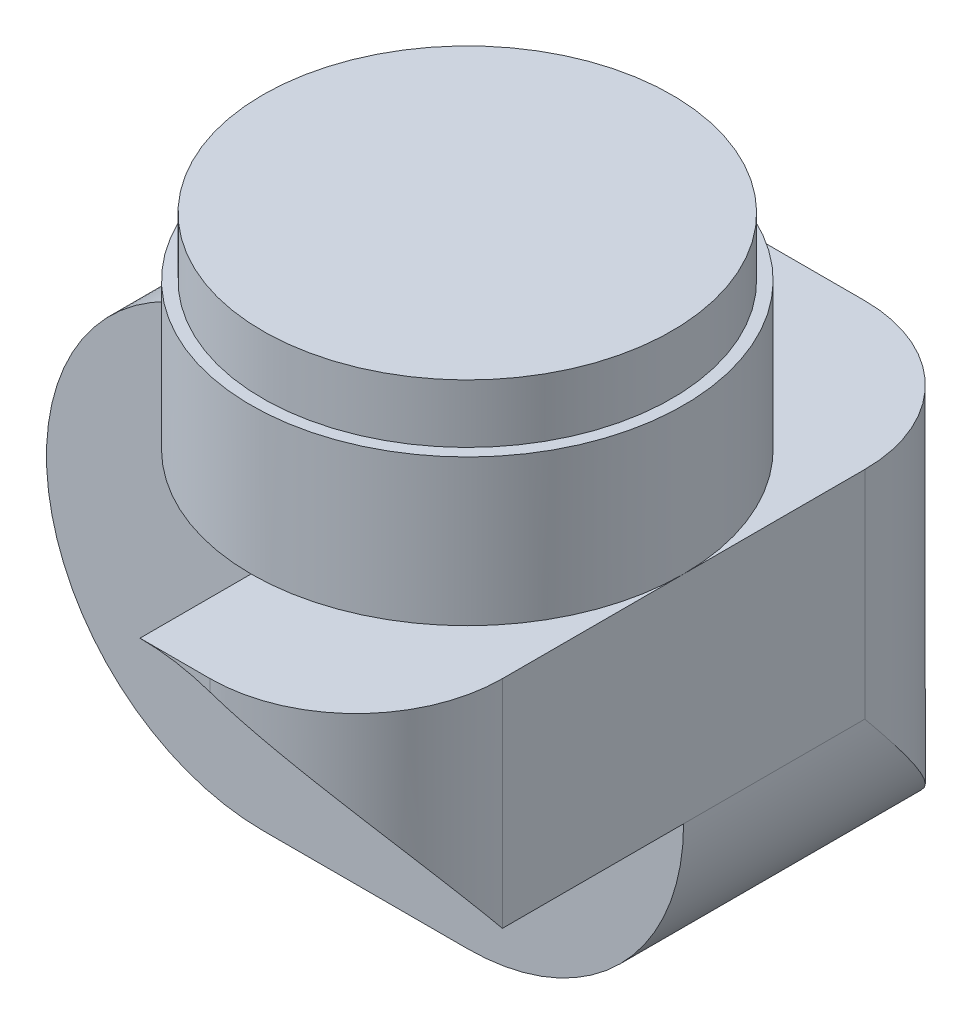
ISO-10303-21;
HEADER;
FILE_DESCRIPTION(('STEP AP214'),'2;1');
FILE_NAME('part.step','',(''),(''),'','','');
FILE_SCHEMA(('AUTOMOTIVE_DESIGN { 1 0 10303 214 1 1 1 1 }'));
ENDSEC;
DATA;
#1=APPLICATION_CONTEXT('core data for automotive mechanical design processes');
#2=APPLICATION_PROTOCOL_DEFINITION('international standard','automotive_design',2000,#1);
#3=PRODUCT_CONTEXT('',#1,'mechanical');
#4=PRODUCT('Part','Part','',(#3));
#5=PRODUCT_RELATED_PRODUCT_CATEGORY('part','',(#4));
#6=PRODUCT_DEFINITION_FORMATION('','',#4);
#7=PRODUCT_DEFINITION_CONTEXT('part definition',#1,'design');
#8=PRODUCT_DEFINITION('design','',#6,#7);
#9=PRODUCT_DEFINITION_SHAPE('','',#8);
#10=(LENGTH_UNIT() NAMED_UNIT(*) SI_UNIT(.MILLI.,.METRE.));
#11=(NAMED_UNIT(*) PLANE_ANGLE_UNIT() SI_UNIT($,.RADIAN.));
#12=(NAMED_UNIT(*) SI_UNIT($,.STERADIAN.) SOLID_ANGLE_UNIT());
#13=UNCERTAINTY_MEASURE_WITH_UNIT(LENGTH_MEASURE(1.E-05),#10,'distance_accuracy_value','');
#14=(GEOMETRIC_REPRESENTATION_CONTEXT(3) GLOBAL_UNCERTAINTY_ASSIGNED_CONTEXT((#13)) GLOBAL_UNIT_ASSIGNED_CONTEXT((#10,
#11,#12)) REPRESENTATION_CONTEXT('',''));
#15=CARTESIAN_POINT('',(0.,0.,0.));
#16=DIRECTION('',(0.,0.,1.));
#17=DIRECTION('',(1.,0.,0.));
#18=AXIS2_PLACEMENT_3D('',#15,#16,#17);
#19=CARTESIAN_POINT('',(-35.,-590.,-56.));
#20=DIRECTION('',(0.,0.,1.));
#21=DIRECTION('',(1.,0.,0.));
#22=AXIS2_PLACEMENT_3D('',#19,#20,#21);
#23=PLANE('',#22);
#24=DIRECTION('',(-1.,0.,0.));
#25=VECTOR('',#24,1.);
#26=CARTESIAN_POINT('',(37.0000000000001,-553.,-56.));
#27=LINE('',#26,#25);
#28=CARTESIAN_POINT('',(12.0000000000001,-553.,-56.));
#29=VERTEX_POINT('',#28);
#30=CARTESIAN_POINT('',(-35.,-553.,-56.));
#31=VERTEX_POINT('',#30);
#32=EDGE_CURVE('E253',#29,#31,#27,.T.);
#33=ORIENTED_EDGE('',*,*,#32,.F.);
#34=DIRECTION('',(0.,1.,0.));
#35=VECTOR('',#34,1.);
#36=CARTESIAN_POINT('',(12.0000000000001,-590.,-56.));
#37=LINE('',#36,#35);
#38=CARTESIAN_POINT('',(12.0000000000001,-625.,-56.));
#39=VERTEX_POINT('',#38);
#40=EDGE_CURVE('E55',#29,#39,#37,.F.);
#41=ORIENTED_EDGE('',*,*,#40,.T.);
#42=CARTESIAN_POINT('',(0.,-590.,-56.));
#43=DIRECTION('',(0.,0.,1.));
#44=DIRECTION('',(1.,0.,0.));
#45=AXIS2_PLACEMENT_3D('',#42,#43,#44);
#46=CIRCLE('',#45,37.);
#47=CARTESIAN_POINT('',(0.,-627.,-56.));
#48=VERTEX_POINT('',#47);
#49=EDGE_CURVE('E264',#48,#39,#46,.T.);
#50=ORIENTED_EDGE('',*,*,#49,.F.);
#51=DIRECTION('',(1.,0.,0.));
#52=VECTOR('',#51,1.);
#53=CARTESIAN_POINT('',(-35.,-627.,-56.));
#54=LINE('',#53,#52);
#55=CARTESIAN_POINT('',(-35.,-627.,-56.));
#56=VERTEX_POINT('',#55);
#57=EDGE_CURVE('E418',#56,#48,#54,.T.);
#58=ORIENTED_EDGE('',*,*,#57,.F.);
#59=CARTESIAN_POINT('',(-35.,-590.,-56.));
#60=DIRECTION('',(0.,0.,1.));
#61=DIRECTION('',(1.,0.,0.));
#62=AXIS2_PLACEMENT_3D('',#59,#60,#61);
#63=CIRCLE('',#62,37.);
#64=EDGE_CURVE('E137',#31,#56,#63,.T.);
#65=ORIENTED_EDGE('',*,*,#64,.F.);
#66=EDGE_LOOP('',(#33,#41,#50,#58,#65));
#67=FACE_BOUND('',#66,.T.);
#68=CARTESIAN_POINT('',(-35.,-590.,-56.));
#69=DIRECTION('',(0.,0.,1.));
#70=DIRECTION('',(1.,0.,0.));
#71=AXIS2_PLACEMENT_3D('',#68,#69,#70);
#72=CIRCLE('',#71,35.);
#73=CARTESIAN_POINT('',(0.,-590.,-56.));
#74=VERTEX_POINT('',#73);
#75=EDGE_CURVE('E11',#74,#74,#72,.F.);
#76=ORIENTED_EDGE('',*,*,#75,.F.);
#77=EDGE_LOOP('',(#76));
#78=FACE_BOUND('',#77,.T.);
#79=ADVANCED_FACE('F32',(#67,#78),#23,.F.);
#80=CARTESIAN_POINT('',(-35.,-590.,56.));
#81=DIRECTION('',(0.,0.,-1.));
#82=DIRECTION('',(-1.,0.,0.));
#83=AXIS2_PLACEMENT_3D('',#80,#81,#82);
#84=CYLINDRICAL_SURFACE('',#83,37.);
#85=CARTESIAN_POINT('',(-35.,-590.,0.));
#86=DIRECTION('',(0.,0.,1.));
#87=DIRECTION('',(1.,0.,0.));
#88=AXIS2_PLACEMENT_3D('',#85,#86,#87);
#89=CIRCLE('',#88,37.);
#90=CARTESIAN_POINT('',(-35.,-553.,0.));
#91=VERTEX_POINT('',#90);
#92=CARTESIAN_POINT('',(-35.,-627.,0.));
#93=VERTEX_POINT('',#92);
#94=EDGE_CURVE('E110',#91,#93,#89,.T.);
#95=ORIENTED_EDGE('',*,*,#94,.F.);
#96=DIRECTION('',(0.,0.,-1.));
#97=VECTOR('',#96,1.);
#98=CARTESIAN_POINT('',(-35.,-553.,56.));
#99=LINE('',#98,#97);
#100=CARTESIAN_POINT('',(-35.,-553.,-11.9999999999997));
#101=VERTEX_POINT('',#100);
#102=EDGE_CURVE('E246',#91,#101,#99,.T.);
#103=ORIENTED_EDGE('',*,*,#102,.T.);
#104=EDGE_CURVE('E249',#101,#31,#99,.T.);
#105=ORIENTED_EDGE('',*,*,#104,.T.);
#106=ORIENTED_EDGE('',*,*,#64,.T.);
#107=DIRECTION('',(0.,0.,-1.));
#108=VECTOR('',#107,1.);
#109=CARTESIAN_POINT('',(-35.,-627.,56.));
#110=LINE('',#109,#108);
#111=EDGE_CURVE('E128',#93,#56,#110,.T.);
#112=ORIENTED_EDGE('',*,*,#111,.F.);
#113=EDGE_LOOP('',(#95,#103,#105,#106,#112));
#114=FACE_BOUND('',#113,.T.);
#115=ADVANCED_FACE('F134',(#114),#84,.T.);
#116=CARTESIAN_POINT('',(-35.,-627.,56.));
#117=DIRECTION('',(0.,1.,0.));
#118=DIRECTION('',(0.,0.,1.));
#119=AXIS2_PLACEMENT_3D('',#116,#117,#118);
#120=PLANE('',#119);
#121=DIRECTION('',(1.,0.,0.));
#122=VECTOR('',#121,1.);
#123=CARTESIAN_POINT('',(-35.,-627.,0.));
#124=LINE('',#123,#122);
#125=CARTESIAN_POINT('',(0.,-627.,0.));
#126=VERTEX_POINT('',#125);
#127=EDGE_CURVE('E114',#93,#126,#124,.T.);
#128=ORIENTED_EDGE('',*,*,#127,.F.);
#129=ORIENTED_EDGE('',*,*,#111,.T.);
#130=ORIENTED_EDGE('',*,*,#57,.T.);
#131=DIRECTION('',(0.,0.,-1.));
#132=VECTOR('',#131,1.);
#133=CARTESIAN_POINT('',(0.,-627.,56.));
#134=LINE('',#133,#132);
#135=EDGE_CURVE('E130',#126,#48,#134,.T.);
#136=ORIENTED_EDGE('',*,*,#135,.F.);
#137=EDGE_LOOP('',(#128,#129,#130,#136));
#138=FACE_BOUND('',#137,.T.);
#139=ADVANCED_FACE('F126',(#138),#120,.F.);
#140=CARTESIAN_POINT('',(0.,-590.,56.));
#141=DIRECTION('',(0.,0.,-1.));
#142=DIRECTION('',(-1.,0.,0.));
#143=AXIS2_PLACEMENT_3D('',#140,#141,#142);
#144=CYLINDRICAL_SURFACE('',#143,37.);
#145=CARTESIAN_POINT('',(0.,-590.,0.));
#146=DIRECTION('',(0.,0.,1.));
#147=DIRECTION('',(-1.,0.,0.));
#148=AXIS2_PLACEMENT_3D('',#145,#146,#147);
#149=CIRCLE('',#148,36.9999999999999);
#150=CARTESIAN_POINT('',(37.0000000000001,-590.,0.));
#151=VERTEX_POINT('',#150);
#152=EDGE_CURVE('E413',#126,#151,#149,.T.);
#153=ORIENTED_EDGE('',*,*,#152,.F.);
#154=ORIENTED_EDGE('',*,*,#135,.T.);
#155=ORIENTED_EDGE('',*,*,#49,.T.);
#156=CARTESIAN_POINT('',(12.0000000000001,-625.,-56.));
#157=CARTESIAN_POINT('',(12.350024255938,-624.880004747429,-56.0000087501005));
#158=CARTESIAN_POINT('',(12.6982160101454,-624.754744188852,-55.9926493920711));
#159=CARTESIAN_POINT('',(13.3901199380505,-624.494073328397,-55.9637201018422));
#160=CARTESIAN_POINT('',(13.7338328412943,-624.358664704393,-55.9421525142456));
#161=CARTESIAN_POINT('',(14.4155751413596,-624.078246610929,-55.8853741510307));
#162=CARTESIAN_POINT('',(14.7536122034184,-623.933251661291,-55.8501836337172));
#163=CARTESIAN_POINT('',(15.4238605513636,-623.633901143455,-55.766737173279));
#164=CARTESIAN_POINT('',(15.7560716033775,-623.479545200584,-55.7184807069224));
#165=CARTESIAN_POINT('',(16.7364305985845,-623.006279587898,-55.5560956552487));
#166=CARTESIAN_POINT('',(17.3753705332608,-622.674256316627,-55.4237382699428));
#167=CARTESIAN_POINT('',(18.6248083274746,-621.978563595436,-55.1148619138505));
#168=CARTESIAN_POINT('',(19.235292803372,-621.614879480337,-54.938322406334));
#169=CARTESIAN_POINT('',(20.5584104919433,-620.77491028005,-54.5019399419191));
#170=CARTESIAN_POINT('',(21.2633816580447,-620.29162490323,-54.232297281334));
#171=CARTESIAN_POINT('',(22.6245312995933,-619.289001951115,-53.6422154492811));
#172=CARTESIAN_POINT('',(23.2807035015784,-618.76965975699,-53.3217697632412));
#173=CARTESIAN_POINT('',(24.545932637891,-617.698144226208,-52.6360670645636));
#174=CARTESIAN_POINT('',(25.1547874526,-617.145846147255,-52.2706333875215));
#175=CARTESIAN_POINT('',(26.3225144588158,-616.015111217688,-51.5025383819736));
#176=CARTESIAN_POINT('',(26.8813826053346,-615.43667225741,-51.0998740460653));
#177=CARTESIAN_POINT('',(28.155765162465,-614.03055189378,-50.1017060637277));
#178=CARTESIAN_POINT('',(28.8487096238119,-613.192680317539,-49.4916615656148));
#179=CARTESIAN_POINT('',(30.1431940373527,-611.483435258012,-48.2234147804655));
#180=CARTESIAN_POINT('',(30.7447005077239,-610.612049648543,-47.5651949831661));
#181=CARTESIAN_POINT('',(31.8601695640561,-608.842104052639,-46.2100155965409));
#182=CARTESIAN_POINT('',(32.3740369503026,-607.943515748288,-45.5130149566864));
#183=CARTESIAN_POINT('',(33.3166904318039,-606.125947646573,-44.0892177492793));
#184=CARTESIAN_POINT('',(33.7454811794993,-605.20696896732,-43.3624228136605));
#185=CARTESIAN_POINT('',(34.6177030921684,-603.122129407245,-41.701643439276));
#186=CARTESIAN_POINT('',(35.0381591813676,-601.951809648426,-40.761158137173));
#187=CARTESIAN_POINT('',(35.755830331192,-599.59374787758,-38.8548160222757));
#188=CARTESIAN_POINT('',(36.0529989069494,-598.405999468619,-37.8889497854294));
#189=CARTESIAN_POINT('',(36.5267596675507,-596.022397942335,-35.9435081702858));
#190=CARTESIAN_POINT('',(36.7036136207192,-594.826568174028,-34.9639673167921));
#191=CARTESIAN_POINT('',(36.9397072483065,-592.430241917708,-32.9976343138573));
#192=CARTESIAN_POINT('',(36.9990244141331,-591.229749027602,-32.0108473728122));
#193=CARTESIAN_POINT('',(36.999996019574,-590.019812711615,-31.0162859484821));
#194=CARTESIAN_POINT('',(36.9999999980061,-590.009906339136,-31.0081429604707));
#195=CARTESIAN_POINT('',(37.0000000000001,-590.,-31.));
#196=B_SPLINE_CURVE_WITH_KNOTS('',3,(#156,#157,#158,#159,#160,#161,#162,#163,#164,#165,#166,
#167,#168,#169,#170,#171,#172,#173,#174,#175,#176,#177,#178,#179,#180,#181,#182,#183,#184,#185,
#186,#187,#188,#189,#190,#191,#192,#193,#194,#195),.UNSPECIFIED.,.F.,.F.,(4,2,2,2,2,2,2,2,2,2,2,
2,2,2,2,2,2,2,2,4),(0.,1.10990953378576,2.21963595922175,3.3277184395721,4.43584530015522,
6.62917781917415,8.82353174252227,11.5082879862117,14.1933887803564,16.8893918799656,
19.5856129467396,23.3202782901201,27.0563078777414,30.7963703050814,34.5362281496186,
39.2079700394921,43.8814717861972,48.5447726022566,53.2049979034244,53.2434686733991),.UNSPECIFIED.);
#197=CARTESIAN_POINT('',(37.0000000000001,-590.,-31.));
#198=VERTEX_POINT('',#197);
#199=EDGE_CURVE('E167',#39,#198,#196,.T.);
#200=ORIENTED_EDGE('',*,*,#199,.T.);
#201=DIRECTION('',(0.,0.,-1.));
#202=VECTOR('',#201,1.);
#203=CARTESIAN_POINT('',(37.0000000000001,-590.,56.));
#204=LINE('',#203,#202);
#205=EDGE_CURVE('E258',#151,#198,#204,.T.);
#206=ORIENTED_EDGE('',*,*,#205,.F.);
#207=EDGE_LOOP('',(#153,#154,#155,#200,#206));
#208=FACE_BOUND('',#207,.T.);
#209=ADVANCED_FACE('F180',(#208),#144,.T.);
#210=CARTESIAN_POINT('',(-35.,-590.,56.));
#211=DIRECTION('',(0.,0.,1.));
#212=DIRECTION('',(1.,0.,0.));
#213=AXIS2_PLACEMENT_3D('',#210,#211,#212);
#214=PLANE('',#213);
#215=DIRECTION('',(-1.,0.,0.));
#216=VECTOR('',#215,1.);
#217=CARTESIAN_POINT('',(37.0000000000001,-553.,56.));
#218=LINE('',#217,#216);
#219=CARTESIAN_POINT('',(12.0000000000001,-553.,56.));
#220=VERTEX_POINT('',#219);
#221=CARTESIAN_POINT('',(0.,-553.,56.));
#222=VERTEX_POINT('',#221);
#223=EDGE_CURVE('E254',#220,#222,#218,.T.);
#224=ORIENTED_EDGE('',*,*,#223,.T.);
#225=CARTESIAN_POINT('',(0.,-590.,56.));
#226=DIRECTION('',(0.,0.,1.));
#227=DIRECTION('',(1.,0.,0.));
#228=AXIS2_PLACEMENT_3D('',#225,#226,#227);
#229=CIRCLE('',#228,37.);
#230=CARTESIAN_POINT('',(12.0000000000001,-555.,56.));
#231=VERTEX_POINT('',#230);
#232=EDGE_CURVE('E410',#231,#222,#229,.T.);
#233=ORIENTED_EDGE('',*,*,#232,.F.);
#234=DIRECTION('',(0.,1.,0.));
#235=VECTOR('',#234,1.);
#236=CARTESIAN_POINT('',(12.0000000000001,-553.,56.));
#237=LINE('',#236,#235);
#238=EDGE_CURVE('E157',#231,#220,#237,.T.);
#239=ORIENTED_EDGE('',*,*,#238,.T.);
#240=EDGE_LOOP('',(#224,#233,#239));
#241=FACE_BOUND('',#240,.T.);
#242=ADVANCED_FACE('F185',(#241),#214,.T.);
#243=CARTESIAN_POINT('',(12.0000000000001,-590.,31.));
#244=DIRECTION('',(0.,-1.,0.));
#245=DIRECTION('',(0.,0.,-1.));
#246=AXIS2_PLACEMENT_3D('',#243,#244,#245);
#247=CYLINDRICAL_SURFACE('',#246,25.);
#248=ORIENTED_EDGE('',*,*,#238,.F.);
#249=CARTESIAN_POINT('',(12.0000000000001,-555.,56.));
#250=CARTESIAN_POINT('',(12.3500242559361,-555.11999525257,56.0000087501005));
#251=CARTESIAN_POINT('',(12.6982160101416,-555.245255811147,55.9926493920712));
#252=CARTESIAN_POINT('',(13.3901199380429,-555.5059266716,55.9637201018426));
#253=CARTESIAN_POINT('',(13.7338328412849,-555.641335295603,55.9421525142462));
#254=CARTESIAN_POINT('',(14.4155751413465,-555.921753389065,55.885374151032));
#255=CARTESIAN_POINT('',(14.7536122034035,-556.066748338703,55.8501836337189));
#256=CARTESIAN_POINT('',(15.4238605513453,-556.366098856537,55.7667371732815));
#257=CARTESIAN_POINT('',(15.7560716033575,-556.520454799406,55.7184807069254));
#258=CARTESIAN_POINT('',(16.7364305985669,-556.993720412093,55.5560956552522));
#259=CARTESIAN_POINT('',(17.375370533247,-557.325743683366,55.4237382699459));
#260=CARTESIAN_POINT('',(18.6248083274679,-558.02143640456,55.1148619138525));
#261=CARTESIAN_POINT('',(19.2352928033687,-558.385120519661,54.9383224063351));
#262=CARTESIAN_POINT('',(20.5584104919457,-559.225089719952,54.5019399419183));
#263=CARTESIAN_POINT('',(21.2633816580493,-559.708375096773,54.2322972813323));
#264=CARTESIAN_POINT('',(22.6245312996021,-560.710998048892,53.642215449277));
#265=CARTESIAN_POINT('',(23.2807035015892,-561.230340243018,53.3217697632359));
#266=CARTESIAN_POINT('',(24.5459326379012,-562.301855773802,52.6360670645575));
#267=CARTESIAN_POINT('',(25.1547874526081,-562.854153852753,52.2706333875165));
#268=CARTESIAN_POINT('',(26.3225144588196,-563.984888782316,51.5025383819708));
#269=CARTESIAN_POINT('',(26.8813826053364,-564.563327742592,51.0998740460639));
#270=CARTESIAN_POINT('',(28.1557651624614,-565.969448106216,50.1017060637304));
#271=CARTESIAN_POINT('',(28.8487096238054,-566.807319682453,49.4916615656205));
#272=CARTESIAN_POINT('',(30.1431940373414,-568.516564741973,48.2234147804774));
#273=CARTESIAN_POINT('',(30.7447005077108,-569.387950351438,47.5651949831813));
#274=CARTESIAN_POINT('',(31.8601695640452,-571.157895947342,46.2100155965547));
#275=CARTESIAN_POINT('',(32.3740369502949,-572.056484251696,45.5130149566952));
#276=CARTESIAN_POINT('',(33.3166904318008,-573.874052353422,44.0892177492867));
#277=CARTESIAN_POINT('',(33.7454811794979,-574.793031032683,43.3624228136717));
#278=CARTESIAN_POINT('',(34.6177030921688,-576.877870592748,41.7016434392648));
#279=CARTESIAN_POINT('',(35.0381591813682,-578.048190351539,40.7611581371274));
#280=CARTESIAN_POINT('',(35.7558303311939,-580.406252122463,38.8548160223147));
#281=CARTESIAN_POINT('',(36.052998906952,-581.594000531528,37.8889497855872));
#282=CARTESIAN_POINT('',(36.5267596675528,-583.977602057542,35.9435081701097));
#283=CARTESIAN_POINT('',(36.7036136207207,-585.173431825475,34.9639673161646));
#284=CARTESIAN_POINT('',(36.9397072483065,-587.569758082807,32.9976343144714));
#285=CARTESIAN_POINT('',(36.9990244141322,-588.770250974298,32.0108473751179));
#286=CARTESIAN_POINT('',(36.9999960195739,-589.980187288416,31.0162859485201));
#287=CARTESIAN_POINT('',(36.9999999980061,-589.99009366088,31.0081429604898));
#288=CARTESIAN_POINT('',(37.,-590.,31.));
#289=B_SPLINE_CURVE_WITH_KNOTS('',3,(#249,#250,#251,#252,#253,#254,#255,#256,#257,#258,#259,
#260,#261,#262,#263,#264,#265,#266,#267,#268,#269,#270,#271,#272,#273,#274,#275,#276,#277,#278,
#279,#280,#281,#282,#283,#284,#285,#286,#287,#288),.UNSPECIFIED.,.F.,.F.,(4,2,2,2,2,2,2,2,2,2,2,
2,2,2,2,2,2,2,2,4),(0.,1.10990953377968,2.21963595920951,3.32771843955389,4.435845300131,
6.62917781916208,8.82353174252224,11.5082879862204,14.1933887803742,16.8893918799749,
19.5856129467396,23.3202782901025,27.0563078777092,30.7963703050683,34.5362281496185,
39.2079700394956,43.8814717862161,48.5447726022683,53.2049979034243,53.243468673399),.UNSPECIFIED.);
#290=CARTESIAN_POINT('',(37.0000000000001,-590.,31.));
#291=VERTEX_POINT('',#290);
#292=EDGE_CURVE('E41',#231,#291,#289,.T.);
#293=ORIENTED_EDGE('',*,*,#292,.T.);
#294=DIRECTION('',(0.,1.,0.));
#295=VECTOR('',#294,1.);
#296=CARTESIAN_POINT('',(37.0000000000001,-590.,31.));
#297=LINE('',#296,#295);
#298=CARTESIAN_POINT('',(37.0000000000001,-553.,31.));
#299=VERTEX_POINT('',#298);
#300=EDGE_CURVE('E164',#299,#291,#297,.F.);
#301=ORIENTED_EDGE('',*,*,#300,.F.);
#302=CARTESIAN_POINT('',(12.0000000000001,-553.,31.));
#303=DIRECTION('',(0.,-1.,0.));
#304=DIRECTION('',(0.,0.,-1.));
#305=AXIS2_PLACEMENT_3D('',#302,#303,#304);
#306=CIRCLE('',#305,25.);
#307=EDGE_CURVE('E159',#220,#299,#306,.F.);
#308=ORIENTED_EDGE('',*,*,#307,.F.);
#309=EDGE_LOOP('',(#248,#293,#301,#308));
#310=FACE_BOUND('',#309,.T.);
#311=ADVANCED_FACE('F211',(#310),#247,.T.);
#312=CARTESIAN_POINT('',(0.,22.74636757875,0.));
#313=DIRECTION('',(0.,1.,0.));
#314=DIRECTION('',(-1.,0.,0.));
#315=AXIS2_PLACEMENT_3D('',#312,#313,#314);
#316=CYLINDRICAL_SURFACE('',#315,35.);
#317=CARTESIAN_POINT('',(0.,-518.,0.));
#318=DIRECTION('',(0.,1.,0.));
#319=DIRECTION('',(-1.,0.,0.));
#320=AXIS2_PLACEMENT_3D('',#317,#318,#319);
#321=CIRCLE('',#320,35.);
#322=CARTESIAN_POINT('',(-34.9999999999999,-518.,0.));
#323=VERTEX_POINT('',#322);
#324=EDGE_CURVE('E153',#323,#323,#321,.T.);
#325=ORIENTED_EDGE('',*,*,#324,.F.);
#326=EDGE_LOOP('',(#325));
#327=FACE_BOUND('',#326,.T.);
#328=CARTESIAN_POINT('',(0.,-528.,0.));
#329=DIRECTION('',(0.,1.,0.));
#330=DIRECTION('',(-1.,0.,0.));
#331=AXIS2_PLACEMENT_3D('',#328,#329,#330);
#332=CIRCLE('',#331,35.);
#333=CARTESIAN_POINT('',(-34.9999999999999,-528.,0.));
#334=VERTEX_POINT('',#333);
#335=EDGE_CURVE('E138',#334,#334,#332,.T.);
#336=ORIENTED_EDGE('',*,*,#335,.T.);
#337=EDGE_LOOP('',(#336));
#338=FACE_BOUND('',#337,.T.);
#339=ADVANCED_FACE('F208',(#327,#338),#316,.T.);
#340=CARTESIAN_POINT('',(35.0000000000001,-518.,0.));
#341=DIRECTION('',(0.,-1.,0.));
#342=DIRECTION('',(1.,0.,0.));
#343=AXIS2_PLACEMENT_3D('',#340,#341,#342);
#344=PLANE('',#343);
#345=ORIENTED_EDGE('',*,*,#324,.T.);
#346=EDGE_LOOP('',(#345));
#347=FACE_BOUND('',#346,.T.);
#348=ADVANCED_FACE('F205',(#347),#344,.F.);
#349=CARTESIAN_POINT('',(37.0000000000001,-553.,0.));
#350=DIRECTION('',(0.,1.,0.));
#351=DIRECTION('',(-1.,0.,0.));
#352=AXIS2_PLACEMENT_3D('',#349,#350,#351);
#353=PLANE('',#352);
#354=CARTESIAN_POINT('',(0.,-553.,0.));
#355=DIRECTION('',(0.,1.,0.));
#356=DIRECTION('',(-1.,0.,0.));
#357=AXIS2_PLACEMENT_3D('',#354,#355,#356);
#358=CIRCLE('',#357,37.);
#359=CARTESIAN_POINT('',(0.,-553.,37.));
#360=VERTEX_POINT('',#359);
#361=EDGE_CURVE('E150',#101,#360,#358,.T.);
#362=ORIENTED_EDGE('',*,*,#361,.F.);
#363=ORIENTED_EDGE('',*,*,#102,.F.);
#364=DIRECTION('',(-1.,0.,0.));
#365=VECTOR('',#364,1.);
#366=CARTESIAN_POINT('',(0.,-553.,0.));
#367=LINE('',#366,#365);
#368=CARTESIAN_POINT('',(0.,-553.,0.));
#369=VERTEX_POINT('',#368);
#370=EDGE_CURVE('E118',#369,#91,#367,.T.);
#371=ORIENTED_EDGE('',*,*,#370,.F.);
#372=DIRECTION('',(0.,0.,-1.));
#373=VECTOR('',#372,1.);
#374=CARTESIAN_POINT('',(0.,-553.,56.));
#375=LINE('',#374,#373);
#376=EDGE_CURVE('E247',#360,#369,#375,.T.);
#377=ORIENTED_EDGE('',*,*,#376,.F.);
#378=EDGE_LOOP('',(#362,#363,#371,#377));
#379=FACE_BOUND('',#378,.T.);
#380=ADVANCED_FACE('F201',(#379),#353,.F.);
#381=CARTESIAN_POINT('',(0.,22.74636757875,0.));
#382=DIRECTION('',(0.,1.,0.));
#383=DIRECTION('',(-1.,0.,0.));
#384=AXIS2_PLACEMENT_3D('',#381,#382,#383);
#385=CYLINDRICAL_SURFACE('',#384,37.);
#386=CARTESIAN_POINT('',(0.,-528.,0.));
#387=DIRECTION('',(0.,1.,0.));
#388=DIRECTION('',(-1.,0.,0.));
#389=AXIS2_PLACEMENT_3D('',#386,#387,#388);
#390=CIRCLE('',#389,37.);
#391=CARTESIAN_POINT('',(-36.9999999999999,-528.,0.));
#392=VERTEX_POINT('',#391);
#393=EDGE_CURVE('E141',#392,#392,#390,.T.);
#394=ORIENTED_EDGE('',*,*,#393,.F.);
#395=EDGE_LOOP('',(#394));
#396=FACE_BOUND('',#395,.T.);
#397=ORIENTED_EDGE('',*,*,#361,.T.);
#398=CARTESIAN_POINT('',(37.0000000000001,-553.,0.));
#399=VERTEX_POINT('',#398);
#400=EDGE_CURVE('E154',#360,#399,#358,.T.);
#401=ORIENTED_EDGE('',*,*,#400,.T.);
#402=EDGE_CURVE('E149',#399,#101,#358,.T.);
#403=ORIENTED_EDGE('',*,*,#402,.T.);
#404=EDGE_LOOP('',(#397,#401,#403));
#405=FACE_BOUND('',#404,.T.);
#406=ADVANCED_FACE('F197',(#396,#405),#385,.T.);
#407=CARTESIAN_POINT('',(37.0000000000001,-528.,0.));
#408=DIRECTION('',(0.,-1.,0.));
#409=DIRECTION('',(1.,0.,0.));
#410=AXIS2_PLACEMENT_3D('',#407,#408,#409);
#411=PLANE('',#410);
#412=ORIENTED_EDGE('',*,*,#335,.F.);
#413=EDGE_LOOP('',(#412));
#414=FACE_BOUND('',#413,.T.);
#415=ORIENTED_EDGE('',*,*,#393,.T.);
#416=EDGE_LOOP('',(#415));
#417=FACE_BOUND('',#416,.T.);
#418=ADVANCED_FACE('F193',(#414,#417),#411,.F.);
#419=CARTESIAN_POINT('',(37.0000000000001,-553.,56.));
#420=DIRECTION('',(0.,-1.,0.));
#421=DIRECTION('',(0.,0.,-1.));
#422=AXIS2_PLACEMENT_3D('',#419,#420,#421);
#423=PLANE('',#422);
#424=ORIENTED_EDGE('',*,*,#400,.F.);
#425=EDGE_CURVE('E239',#222,#360,#375,.T.);
#426=ORIENTED_EDGE('',*,*,#425,.F.);
#427=ORIENTED_EDGE('',*,*,#223,.F.);
#428=ORIENTED_EDGE('',*,*,#307,.T.);
#429=DIRECTION('',(0.,0.,-1.));
#430=VECTOR('',#429,1.);
#431=CARTESIAN_POINT('',(37.0000000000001,-553.,56.));
#432=LINE('',#431,#430);
#433=EDGE_CURVE('E242',#299,#399,#432,.T.);
#434=ORIENTED_EDGE('',*,*,#433,.T.);
#435=EDGE_LOOP('',(#424,#426,#427,#428,#434));
#436=FACE_BOUND('',#435,.T.);
#437=ADVANCED_FACE('F196',(#436),#423,.F.);
#438=CARTESIAN_POINT('',(37.0000000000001,-553.,-31.));
#439=VERTEX_POINT('',#438);
#440=EDGE_CURVE('E250',#399,#439,#432,.T.);
#441=ORIENTED_EDGE('',*,*,#440,.T.);
#442=CARTESIAN_POINT('',(12.0000000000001,-553.,-31.));
#443=DIRECTION('',(0.,-1.,0.));
#444=DIRECTION('',(0.,0.,-1.));
#445=AXIS2_PLACEMENT_3D('',#442,#443,#444);
#446=CIRCLE('',#445,25.);
#447=EDGE_CURVE('E48',#439,#29,#446,.F.);
#448=ORIENTED_EDGE('',*,*,#447,.T.);
#449=ORIENTED_EDGE('',*,*,#32,.T.);
#450=ORIENTED_EDGE('',*,*,#104,.F.);
#451=ORIENTED_EDGE('',*,*,#402,.F.);
#452=EDGE_LOOP('',(#441,#448,#449,#450,#451));
#453=FACE_BOUND('',#452,.T.);
#454=ADVANCED_FACE('F229',(#453),#423,.F.);
#455=CARTESIAN_POINT('',(37.0000000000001,-553.,56.));
#456=DIRECTION('',(-1.,0.,0.));
#457=DIRECTION('',(0.,0.,1.));
#458=AXIS2_PLACEMENT_3D('',#455,#456,#457);
#459=PLANE('',#458);
#460=ORIENTED_EDGE('',*,*,#433,.F.);
#461=ORIENTED_EDGE('',*,*,#300,.T.);
#462=EDGE_CURVE('E143',#291,#151,#204,.T.);
#463=ORIENTED_EDGE('',*,*,#462,.T.);
#464=ORIENTED_EDGE('',*,*,#205,.T.);
#465=DIRECTION('',(0.,1.,0.));
#466=VECTOR('',#465,1.);
#467=CARTESIAN_POINT('',(37.0000000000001,-553.,-31.));
#468=LINE('',#467,#466);
#469=EDGE_CURVE('E161',#198,#439,#468,.T.);
#470=ORIENTED_EDGE('',*,*,#469,.T.);
#471=ORIENTED_EDGE('',*,*,#440,.F.);
#472=EDGE_LOOP('',(#460,#461,#463,#464,#470,#471));
#473=FACE_BOUND('',#472,.T.);
#474=ADVANCED_FACE('F187',(#473),#459,.F.);
#475=CARTESIAN_POINT('',(12.0000000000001,-553.,-31.));
#476=DIRECTION('',(0.,1.,0.));
#477=DIRECTION('',(0.,0.,1.));
#478=AXIS2_PLACEMENT_3D('',#475,#476,#477);
#479=CYLINDRICAL_SURFACE('',#478,25.);
#480=ORIENTED_EDGE('',*,*,#199,.F.);
#481=ORIENTED_EDGE('',*,*,#40,.F.);
#482=ORIENTED_EDGE('',*,*,#447,.F.);
#483=ORIENTED_EDGE('',*,*,#469,.F.);
#484=EDGE_LOOP('',(#480,#481,#482,#483));
#485=FACE_BOUND('',#484,.T.);
#486=ADVANCED_FACE('F176',(#485),#479,.T.);
#487=CARTESIAN_POINT('',(0.,-590.,56.));
#488=DIRECTION('',(0.,0.,-1.));
#489=DIRECTION('',(-1.,0.,0.));
#490=AXIS2_PLACEMENT_3D('',#487,#488,#489);
#491=CYLINDRICAL_SURFACE('',#490,36.9999999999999);
#492=ORIENTED_EDGE('',*,*,#462,.F.);
#493=ORIENTED_EDGE('',*,*,#292,.F.);
#494=ORIENTED_EDGE('',*,*,#232,.T.);
#495=ORIENTED_EDGE('',*,*,#425,.T.);
#496=ORIENTED_EDGE('',*,*,#376,.T.);
#497=EDGE_CURVE('E131',#151,#369,#149,.T.);
#498=ORIENTED_EDGE('',*,*,#497,.F.);
#499=EDGE_LOOP('',(#492,#493,#494,#495,#496,#498));
#500=FACE_BOUND('',#499,.T.);
#501=ADVANCED_FACE('F271',(#500),#491,.F.);
#502=CARTESIAN_POINT('',(-35.,-590.,0.));
#503=DIRECTION('',(0.,0.,1.));
#504=DIRECTION('',(1.,0.,0.));
#505=AXIS2_PLACEMENT_3D('',#502,#503,#504);
#506=PLANE('',#505);
#507=ORIENTED_EDGE('',*,*,#94,.T.);
#508=ORIENTED_EDGE('',*,*,#127,.T.);
#509=ORIENTED_EDGE('',*,*,#152,.T.);
#510=ORIENTED_EDGE('',*,*,#497,.T.);
#511=ORIENTED_EDGE('',*,*,#370,.T.);
#512=EDGE_LOOP('',(#507,#508,#509,#510,#511));
#513=FACE_BOUND('',#512,.T.);
#514=ADVANCED_FACE('F112',(#513),#506,.T.);
#515=CARTESIAN_POINT('',(-35.,-590.,-58.));
#516=DIRECTION('',(0.,0.,1.));
#517=DIRECTION('',(1.,0.,0.));
#518=AXIS2_PLACEMENT_3D('',#515,#516,#517);
#519=CYLINDRICAL_SURFACE('',#518,35.);
#520=CARTESIAN_POINT('',(-35.,-590.,-58.));
#521=DIRECTION('',(0.,0.,-1.));
#522=DIRECTION('',(-1.,0.,0.));
#523=AXIS2_PLACEMENT_3D('',#520,#521,#522);
#524=CIRCLE('',#523,35.);
#525=CARTESIAN_POINT('',(-70.,-590.,-58.));
#526=VERTEX_POINT('',#525);
#527=EDGE_CURVE('E36',#526,#526,#524,.T.);
#528=ORIENTED_EDGE('',*,*,#527,.F.);
#529=EDGE_LOOP('',(#528));
#530=FACE_BOUND('',#529,.T.);
#531=ORIENTED_EDGE('',*,*,#75,.T.);
#532=EDGE_LOOP('',(#531));
#533=FACE_BOUND('',#532,.T.);
#534=ADVANCED_FACE('F278',(#530,#533),#519,.T.);
#535=CARTESIAN_POINT('',(-35.,-590.,144.666666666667));
#536=DIRECTION('',(0.,0.,1.));
#537=DIRECTION('',(1.,0.,0.));
#538=AXIS2_PLACEMENT_3D('',#535,#536,#537);
#539=SPHERICAL_SURFACE('',#538,205.666666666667);
#540=ORIENTED_EDGE('',*,*,#527,.T.);
#541=EDGE_LOOP('',(#540));
#542=FACE_BOUND('',#541,.T.);
#543=ADVANCED_FACE('F34',(#542),#539,.T.);
#544=CLOSED_SHELL('',(#79,#115,#139,#209,#242,#311,#339,#348,#380,#406,#418,#437,#454,#474,#486,
#501,#514,#534,#543));
#545=MANIFOLD_SOLID_BREP('B2',#544);
#546=ADVANCED_BREP_SHAPE_REPRESENTATION('',(#18,#545),#14);
#547=SHAPE_DEFINITION_REPRESENTATION(#9,#546);
ENDSEC;
END-ISO-10303-21;
